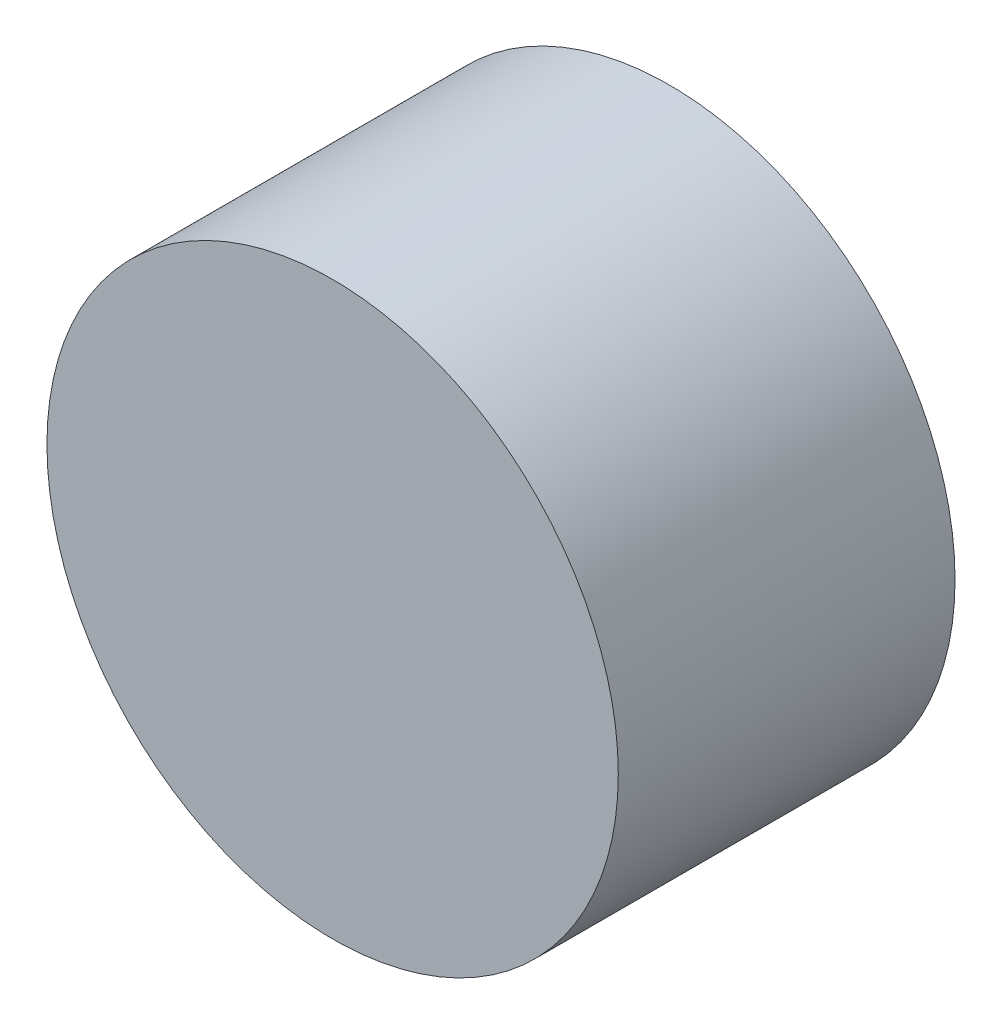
from build123d import *

# Parameters (mm, degrees)
SKETCH1_R      = 1.24968
EXTRUDE1_DEPTH = 1.4732


with BuildPart() as part:
    # Sketch1 → Extrude1 (new body)
    with BuildSketch(Plane.XY):
        Circle(SKETCH1_R)
    extrude(amount=EXTRUDE1_DEPTH)


solid = part.part
